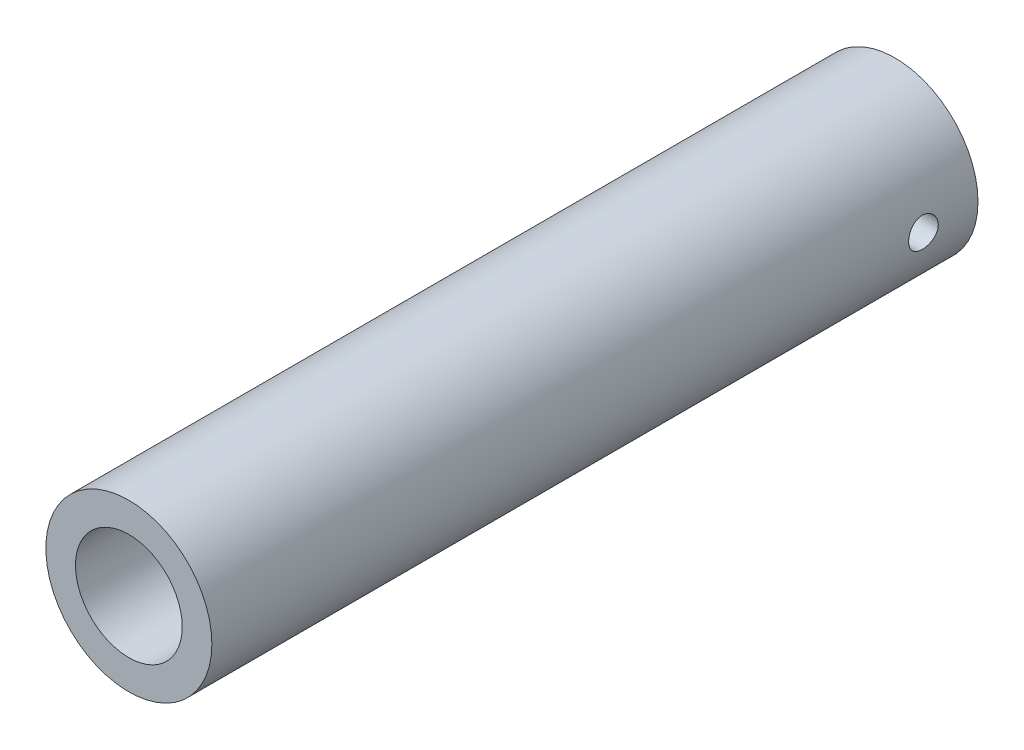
ISO-10303-21;
HEADER;
FILE_DESCRIPTION(('STEP AP214'),'2;1');
FILE_NAME('part.step','',(''),(''),'','','');
FILE_SCHEMA(('AUTOMOTIVE_DESIGN { 1 0 10303 214 1 1 1 1 }'));
ENDSEC;
DATA;
#1=APPLICATION_CONTEXT('core data for automotive mechanical design processes');
#2=APPLICATION_PROTOCOL_DEFINITION('international standard','automotive_design',2000,#1);
#3=PRODUCT_CONTEXT('',#1,'mechanical');
#4=PRODUCT('Part','Part','',(#3));
#5=PRODUCT_RELATED_PRODUCT_CATEGORY('part','',(#4));
#6=PRODUCT_DEFINITION_FORMATION('','',#4);
#7=PRODUCT_DEFINITION_CONTEXT('part definition',#1,'design');
#8=PRODUCT_DEFINITION('design','',#6,#7);
#9=PRODUCT_DEFINITION_SHAPE('','',#8);
#10=(LENGTH_UNIT() NAMED_UNIT(*) SI_UNIT(.MILLI.,.METRE.));
#11=(NAMED_UNIT(*) PLANE_ANGLE_UNIT() SI_UNIT($,.RADIAN.));
#12=(NAMED_UNIT(*) SI_UNIT($,.STERADIAN.) SOLID_ANGLE_UNIT());
#13=UNCERTAINTY_MEASURE_WITH_UNIT(LENGTH_MEASURE(1.E-05),#10,'distance_accuracy_value','');
#14=(GEOMETRIC_REPRESENTATION_CONTEXT(3) GLOBAL_UNCERTAINTY_ASSIGNED_CONTEXT((#13)) GLOBAL_UNIT_ASSIGNED_CONTEXT((#10,
#11,#12)) REPRESENTATION_CONTEXT('',''));
#15=CARTESIAN_POINT('',(0.,0.,0.));
#16=DIRECTION('',(0.,0.,1.));
#17=DIRECTION('',(1.,0.,0.));
#18=AXIS2_PLACEMENT_3D('',#15,#16,#17);
#19=CARTESIAN_POINT('',(0.,0.,129.2));
#20=DIRECTION('',(0.,0.,1.));
#21=DIRECTION('',(1.,0.,0.));
#22=AXIS2_PLACEMENT_3D('',#19,#20,#21);
#23=PLANE('',#22);
#24=CARTESIAN_POINT('',(0.,0.,129.2));
#25=DIRECTION('',(0.,0.,1.));
#26=DIRECTION('',(1.,0.,0.));
#27=AXIS2_PLACEMENT_3D('',#24,#25,#26);
#28=CIRCLE('',#27,14.);
#29=CARTESIAN_POINT('',(14.,0.,129.2));
#30=VERTEX_POINT('',#29);
#31=EDGE_CURVE('E10',#30,#30,#28,.T.);
#32=ORIENTED_EDGE('',*,*,#31,.T.);
#33=EDGE_LOOP('',(#32));
#34=FACE_BOUND('',#33,.T.);
#35=CARTESIAN_POINT('',(0.,0.,129.2));
#36=DIRECTION('',(0.,0.,1.));
#37=DIRECTION('',(1.,0.,0.));
#38=AXIS2_PLACEMENT_3D('',#35,#36,#37);
#39=CIRCLE('',#38,9.);
#40=CARTESIAN_POINT('',(9.,0.,129.2));
#41=VERTEX_POINT('',#40);
#42=EDGE_CURVE('E46',#41,#41,#39,.T.);
#43=ORIENTED_EDGE('',*,*,#42,.F.);
#44=EDGE_LOOP('',(#43));
#45=FACE_BOUND('',#44,.T.);
#46=ADVANCED_FACE('F28',(#34,#45),#23,.T.);
#47=CARTESIAN_POINT('',(0.,0.,0.));
#48=DIRECTION('',(0.,0.,1.));
#49=DIRECTION('',(1.,0.,0.));
#50=AXIS2_PLACEMENT_3D('',#47,#48,#49);
#51=PLANE('',#50);
#52=CARTESIAN_POINT('',(0.,0.,0.));
#53=DIRECTION('',(0.,0.,1.));
#54=DIRECTION('',(1.,0.,0.));
#55=AXIS2_PLACEMENT_3D('',#52,#53,#54);
#56=CIRCLE('',#55,14.);
#57=CARTESIAN_POINT('',(14.,0.,0.));
#58=VERTEX_POINT('',#57);
#59=EDGE_CURVE('E41',#58,#58,#56,.T.);
#60=ORIENTED_EDGE('',*,*,#59,.F.);
#61=EDGE_LOOP('',(#60));
#62=FACE_BOUND('',#61,.T.);
#63=CARTESIAN_POINT('',(0.,0.,0.));
#64=DIRECTION('',(0.,0.,1.));
#65=DIRECTION('',(1.,0.,0.));
#66=AXIS2_PLACEMENT_3D('',#63,#64,#65);
#67=CIRCLE('',#66,9.);
#68=CARTESIAN_POINT('',(9.,0.,0.));
#69=VERTEX_POINT('',#68);
#70=EDGE_CURVE('E75',#69,#69,#67,.T.);
#71=ORIENTED_EDGE('',*,*,#70,.T.);
#72=EDGE_LOOP('',(#71));
#73=FACE_BOUND('',#72,.T.);
#74=ADVANCED_FACE('F83',(#62,#73),#51,.F.);
#75=CARTESIAN_POINT('',(0.,0.,129.2));
#76=DIRECTION('',(0.,0.,-1.));
#77=DIRECTION('',(-1.,0.,0.));
#78=AXIS2_PLACEMENT_3D('',#75,#76,#77);
#79=CYLINDRICAL_SURFACE('',#78,14.);
#80=CARTESIAN_POINT('',(-14.,0.,11.7));
#81=CARTESIAN_POINT('',(-13.9999975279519,-0.139239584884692,11.6999945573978));
#82=CARTESIAN_POINT('',(-13.9979012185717,-0.278551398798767,11.6883280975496));
#83=CARTESIAN_POINT('',(-13.9897405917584,-0.55325746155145,11.6419958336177));
#84=CARTESIAN_POINT('',(-13.9836727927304,-0.688648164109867,11.6073098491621));
#85=CARTESIAN_POINT('',(-13.9682487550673,-0.951498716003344,11.516027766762));
#86=CARTESIAN_POINT('',(-13.9588953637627,-1.07896532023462,11.4594506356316));
#87=CARTESIAN_POINT('',(-13.9379246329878,-1.32258294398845,11.3260443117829));
#88=CARTESIAN_POINT('',(-13.9263075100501,-1.43873504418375,11.2492170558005));
#89=CARTESIAN_POINT('',(-13.9019523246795,-1.65770744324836,11.0766007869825));
#90=CARTESIAN_POINT('',(-13.8892044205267,-1.76038642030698,10.9806338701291));
#91=CARTESIAN_POINT('',(-13.8640984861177,-1.94827611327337,10.7728452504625));
#92=CARTESIAN_POINT('',(-13.851740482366,-2.03348564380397,10.6610224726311));
#93=CARTESIAN_POINT('',(-13.828718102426,-2.18459604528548,10.4237098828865));
#94=CARTESIAN_POINT('',(-13.8180664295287,-2.25035491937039,10.298128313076));
#95=CARTESIAN_POINT('',(-13.799800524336,-2.35978878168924,10.0374788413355));
#96=CARTESIAN_POINT('',(-13.7921860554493,-2.40346549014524,9.90241167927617));
#97=CARTESIAN_POINT('',(-13.7809553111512,-2.46704527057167,9.62813117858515));
#98=CARTESIAN_POINT('',(-13.7772977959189,-2.48719373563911,9.48897644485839));
#99=CARTESIAN_POINT('',(-13.7742705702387,-2.50390640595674,9.20921707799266));
#100=CARTESIAN_POINT('',(-13.7749005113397,-2.50047252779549,9.0686125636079));
#101=CARTESIAN_POINT('',(-13.78033942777,-2.47031736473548,8.79171110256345));
#102=CARTESIAN_POINT('',(-13.7850985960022,-2.44387361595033,8.65538280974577));
#103=CARTESIAN_POINT('',(-13.7981816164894,-2.3688857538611,8.38912936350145));
#104=CARTESIAN_POINT('',(-13.8065056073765,-2.32034078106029,8.25920445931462));
#105=CARTESIAN_POINT('',(-13.8258332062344,-2.20225267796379,8.00862552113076));
#106=CARTESIAN_POINT('',(-13.836851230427,-2.13259607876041,7.88802611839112));
#107=CARTESIAN_POINT('',(-13.8603157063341,-1.97434240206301,7.66012249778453));
#108=CARTESIAN_POINT('',(-13.8727622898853,-1.88574357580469,7.55281950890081));
#109=CARTESIAN_POINT('',(-13.8978993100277,-1.69061708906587,7.35294978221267));
#110=CARTESIAN_POINT('',(-13.9105906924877,-1.58385171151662,7.26061508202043));
#111=CARTESIAN_POINT('',(-13.934623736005,-1.35622200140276,7.09513386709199));
#112=CARTESIAN_POINT('',(-13.9459653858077,-1.23535755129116,7.02198751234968));
#113=CARTESIAN_POINT('',(-13.9660408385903,-0.982729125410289,6.89693097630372));
#114=CARTESIAN_POINT('',(-13.9747718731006,-0.850953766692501,6.8450433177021));
#115=CARTESIAN_POINT('',(-13.9886206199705,-0.580367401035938,6.76420311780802));
#116=CARTESIAN_POINT('',(-13.9937386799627,-0.441557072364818,6.73524836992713));
#117=CARTESIAN_POINT('',(-13.999737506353,-0.162838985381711,6.70141515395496));
#118=CARTESIAN_POINT('',(-14.0006742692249,-0.0229710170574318,6.69621849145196));
#119=CARTESIAN_POINT('',(-13.9983590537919,0.255635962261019,6.70919773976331));
#120=CARTESIAN_POINT('',(-13.9951072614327,0.39437502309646,6.72737261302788));
#121=CARTESIAN_POINT('',(-13.9848150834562,0.665788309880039,6.7863143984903));
#122=CARTESIAN_POINT('',(-13.9778014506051,0.798498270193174,6.82692183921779));
#123=CARTESIAN_POINT('',(-13.960768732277,1.0552266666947,6.92940463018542));
#124=CARTESIAN_POINT('',(-13.9507494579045,1.17924455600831,6.9912813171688));
#125=CARTESIAN_POINT('',(-13.9286773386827,1.4164370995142,7.13526122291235));
#126=CARTESIAN_POINT('',(-13.9166051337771,1.52949072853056,7.21756079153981));
#127=CARTESIAN_POINT('',(-13.8918196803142,1.74029662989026,7.39978265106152));
#128=CARTESIAN_POINT('',(-13.8791063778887,1.8380476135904,7.49970642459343));
#129=CARTESIAN_POINT('',(-13.8542878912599,2.01666949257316,7.71577496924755));
#130=CARTESIAN_POINT('',(-13.8421918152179,2.09732417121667,7.83209970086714));
#131=CARTESIAN_POINT('',(-13.8201546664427,2.23794827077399,8.07683368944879));
#132=CARTESIAN_POINT('',(-13.8102135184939,2.29791841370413,8.20524252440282));
#133=CARTESIAN_POINT('',(-13.7936819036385,2.39515706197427,8.46992617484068));
#134=CARTESIAN_POINT('',(-13.7870762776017,2.43252842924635,8.60616221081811));
#135=CARTESIAN_POINT('',(-13.7779274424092,2.48382895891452,8.88310729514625));
#136=CARTESIAN_POINT('',(-13.7753838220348,2.49776049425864,9.02381588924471));
#137=CARTESIAN_POINT('',(-13.7746664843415,2.50171229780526,9.30354920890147));
#138=CARTESIAN_POINT('',(-13.7764304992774,2.49207328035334,9.44256907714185));
#139=CARTESIAN_POINT('',(-13.7839923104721,2.44989946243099,9.71697381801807));
#140=CARTESIAN_POINT('',(-13.7897900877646,2.4173647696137,9.85235870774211));
#141=CARTESIAN_POINT('',(-13.8047410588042,2.33046113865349,10.1154898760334));
#142=CARTESIAN_POINT('',(-13.8138890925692,2.27612576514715,10.2432475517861));
#143=CARTESIAN_POINT('',(-13.8345140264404,2.14719934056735,10.4878884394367));
#144=CARTESIAN_POINT('',(-13.8459910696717,2.07260704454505,10.6047709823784));
#145=CARTESIAN_POINT('',(-13.8701759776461,1.90408567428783,10.82605704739));
#146=CARTESIAN_POINT('',(-13.882898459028,1.80990741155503,10.9302692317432));
#147=CARTESIAN_POINT('',(-13.9080282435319,1.60540999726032,11.1215258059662));
#148=CARTESIAN_POINT('',(-13.920435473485,1.49508713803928,11.2085662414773));
#149=CARTESIAN_POINT('',(-13.9436534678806,1.26037074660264,11.3636577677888));
#150=CARTESIAN_POINT('',(-13.9544505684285,1.13587103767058,11.4315502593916));
#151=CARTESIAN_POINT('',(-13.9730987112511,0.87708484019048,11.5453492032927));
#152=CARTESIAN_POINT('',(-13.9809525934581,0.742807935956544,11.5912768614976));
#153=CARTESIAN_POINT('',(-13.9911779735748,0.50673175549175,11.6502306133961));
#154=CARTESIAN_POINT('',(-13.9944679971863,0.406334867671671,11.6688631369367));
#155=CARTESIAN_POINT('',(-13.9988798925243,0.20397155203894,11.6937496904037));
#156=CARTESIAN_POINT('',(-14.0000018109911,0.102005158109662,11.7000039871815));
#157=CARTESIAN_POINT('',(-14.,0.,11.7));
#158=B_SPLINE_CURVE_WITH_KNOTS('',3,(#80,#81,#82,#83,#84,#85,#86,#87,#88,#89,#90,#91,#92,#93,
#94,#95,#96,#97,#98,#99,#100,#101,#102,#103,#104,#105,#106,#107,#108,#109,#110,#111,#112,#113,
#114,#115,#116,#117,#118,#119,#120,#121,#122,#123,#124,#125,#126,#127,#128,#129,#130,#131,#132,
#133,#134,#135,#136,#137,#138,#139,#140,#141,#142,#143,#144,#145,#146,#147,#148,#149,#150,#151,
#152,#153,#154,#155,#156,#157),.UNSPECIFIED.,.T.,.F.,(4,2,2,2,2,2,2,2,2,2,2,2,2,2,2,2,2,2,2,2,2,
2,2,2,2,2,2,2,2,2,2,2,2,2,2,2,2,2,4),(0.,0.41734579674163,0.835057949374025,1.25240899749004,
1.66972014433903,2.09110796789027,2.5125243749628,2.93694536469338,3.36133328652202,
3.78125426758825,4.20114112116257,4.61603258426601,5.03094018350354,5.44811857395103,
5.8653354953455,6.28850377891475,6.71167559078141,7.13529458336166,7.55887281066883,
7.97676106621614,8.3946307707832,8.80956740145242,9.2245301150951,9.6436484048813,
10.062801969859,10.4869762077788,10.9111356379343,11.3333496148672,11.7555208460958,
12.1716257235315,12.5877286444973,13.0031933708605,13.4186836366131,13.8398246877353,
14.2610626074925,14.6856934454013,15.109913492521,15.4156623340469,15.7214045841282),.UNSPECIFIED.);
#159=CARTESIAN_POINT('',(-14.,0.,11.7));
#160=VERTEX_POINT('',#159);
#161=EDGE_CURVE('E70',#160,#160,#158,.T.);
#162=ORIENTED_EDGE('',*,*,#161,.T.);
#163=EDGE_LOOP('',(#162));
#164=FACE_BOUND('',#163,.T.);
#165=CARTESIAN_POINT('',(14.,0.,6.7));
#166=CARTESIAN_POINT('',(13.9999975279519,-0.139239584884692,6.70000544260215));
#167=CARTESIAN_POINT('',(13.9979012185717,-0.278551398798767,6.71167190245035));
#168=CARTESIAN_POINT('',(13.9897405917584,-0.55325746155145,6.7580041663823));
#169=CARTESIAN_POINT('',(13.9836727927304,-0.688648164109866,6.79269015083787));
#170=CARTESIAN_POINT('',(13.9682487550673,-0.951498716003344,6.88397223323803));
#171=CARTESIAN_POINT('',(13.9588953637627,-1.07896532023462,6.9405493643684));
#172=CARTESIAN_POINT('',(13.9379246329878,-1.32258294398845,7.07395568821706));
#173=CARTESIAN_POINT('',(13.9263075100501,-1.43873504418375,7.15078294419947));
#174=CARTESIAN_POINT('',(13.9019523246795,-1.65770744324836,7.32339921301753));
#175=CARTESIAN_POINT('',(13.8892044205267,-1.76038642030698,7.4193661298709));
#176=CARTESIAN_POINT('',(13.8640984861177,-1.94827611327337,7.62715474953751));
#177=CARTESIAN_POINT('',(13.851740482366,-2.03348564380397,7.73897752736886));
#178=CARTESIAN_POINT('',(13.828718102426,-2.18459604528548,7.97629011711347));
#179=CARTESIAN_POINT('',(13.8180664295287,-2.25035491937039,8.10187168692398));
#180=CARTESIAN_POINT('',(13.799800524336,-2.35978878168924,8.3625211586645));
#181=CARTESIAN_POINT('',(13.7921860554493,-2.40346549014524,8.49758832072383));
#182=CARTESIAN_POINT('',(13.7809553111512,-2.46704527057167,8.77186882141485));
#183=CARTESIAN_POINT('',(13.7772977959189,-2.48719373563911,8.91102355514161));
#184=CARTESIAN_POINT('',(13.7742705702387,-2.50390640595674,9.19078292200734));
#185=CARTESIAN_POINT('',(13.7749005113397,-2.50047252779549,9.3313874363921));
#186=CARTESIAN_POINT('',(13.78033942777,-2.47031736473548,9.60828889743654));
#187=CARTESIAN_POINT('',(13.7850985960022,-2.44387361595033,9.74461719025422));
#188=CARTESIAN_POINT('',(13.7981816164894,-2.3688857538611,10.0108706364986));
#189=CARTESIAN_POINT('',(13.8065056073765,-2.32034078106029,10.1407955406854));
#190=CARTESIAN_POINT('',(13.8258332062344,-2.2022526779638,10.3913744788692));
#191=CARTESIAN_POINT('',(13.836851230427,-2.13259607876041,10.5119738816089));
#192=CARTESIAN_POINT('',(13.8603157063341,-1.97434240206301,10.7398775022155));
#193=CARTESIAN_POINT('',(13.8727622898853,-1.88574357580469,10.8471804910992));
#194=CARTESIAN_POINT('',(13.8978993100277,-1.69061708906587,11.0470502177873));
#195=CARTESIAN_POINT('',(13.9105906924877,-1.58385171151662,11.1393849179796));
#196=CARTESIAN_POINT('',(13.934623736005,-1.35622200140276,11.304866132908));
#197=CARTESIAN_POINT('',(13.9459653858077,-1.23535755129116,11.3780124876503));
#198=CARTESIAN_POINT('',(13.9660408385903,-0.982729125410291,11.5030690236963));
#199=CARTESIAN_POINT('',(13.9747718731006,-0.850953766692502,11.5549566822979));
#200=CARTESIAN_POINT('',(13.9886206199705,-0.58036740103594,11.635796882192));
#201=CARTESIAN_POINT('',(13.9937386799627,-0.44155707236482,11.6647516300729));
#202=CARTESIAN_POINT('',(13.999737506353,-0.162838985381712,11.698584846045));
#203=CARTESIAN_POINT('',(14.0006742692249,-0.0229710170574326,11.703781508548));
#204=CARTESIAN_POINT('',(13.9983590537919,0.255635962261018,11.6908022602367));
#205=CARTESIAN_POINT('',(13.9951072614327,0.394375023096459,11.6726273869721));
#206=CARTESIAN_POINT('',(13.9848150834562,0.665788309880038,11.6136856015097));
#207=CARTESIAN_POINT('',(13.9778014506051,0.798498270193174,11.5730781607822));
#208=CARTESIAN_POINT('',(13.960768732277,1.0552266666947,11.4705953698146));
#209=CARTESIAN_POINT('',(13.9507494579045,1.17924455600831,11.4087186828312));
#210=CARTESIAN_POINT('',(13.9286773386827,1.4164370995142,11.2647387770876));
#211=CARTESIAN_POINT('',(13.9166051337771,1.52949072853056,11.1824392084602));
#212=CARTESIAN_POINT('',(13.8918196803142,1.74029662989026,11.0002173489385));
#213=CARTESIAN_POINT('',(13.8791063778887,1.8380476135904,10.9002935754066));
#214=CARTESIAN_POINT('',(13.8542878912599,2.01666949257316,10.6842250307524));
#215=CARTESIAN_POINT('',(13.8421918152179,2.09732417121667,10.5679002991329));
#216=CARTESIAN_POINT('',(13.8201546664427,2.23794827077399,10.3231663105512));
#217=CARTESIAN_POINT('',(13.8102135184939,2.29791841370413,10.1947574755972));
#218=CARTESIAN_POINT('',(13.7936819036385,2.39515706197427,9.93007382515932));
#219=CARTESIAN_POINT('',(13.7870762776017,2.43252842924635,9.79383778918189));
#220=CARTESIAN_POINT('',(13.7779274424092,2.48382895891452,9.51689270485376));
#221=CARTESIAN_POINT('',(13.7753838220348,2.49776049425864,9.37618411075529));
#222=CARTESIAN_POINT('',(13.7746664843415,2.50171229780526,9.09645079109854));
#223=CARTESIAN_POINT('',(13.7764304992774,2.49207328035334,8.95743092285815));
#224=CARTESIAN_POINT('',(13.7839923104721,2.44989946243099,8.68302618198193));
#225=CARTESIAN_POINT('',(13.7897900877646,2.4173647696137,8.5476412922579));
#226=CARTESIAN_POINT('',(13.8047410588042,2.33046113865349,8.28451012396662));
#227=CARTESIAN_POINT('',(13.8138890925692,2.27612576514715,8.15675244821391));
#228=CARTESIAN_POINT('',(13.8345140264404,2.14719934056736,7.91211156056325));
#229=CARTESIAN_POINT('',(13.8459910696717,2.07260704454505,7.7952290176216));
#230=CARTESIAN_POINT('',(13.8701759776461,1.90408567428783,7.57394295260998));
#231=CARTESIAN_POINT('',(13.882898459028,1.80990741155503,7.46973076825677));
#232=CARTESIAN_POINT('',(13.9080282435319,1.60540999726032,7.27847419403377));
#233=CARTESIAN_POINT('',(13.920435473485,1.49508713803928,7.19143375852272));
#234=CARTESIAN_POINT('',(13.9436534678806,1.26037074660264,7.03634223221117));
#235=CARTESIAN_POINT('',(13.9544505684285,1.13587103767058,6.96844974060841));
#236=CARTESIAN_POINT('',(13.9730987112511,0.877084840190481,6.85465079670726));
#237=CARTESIAN_POINT('',(13.9809525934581,0.742807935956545,6.80872313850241));
#238=CARTESIAN_POINT('',(13.9911779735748,0.506731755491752,6.74976938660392));
#239=CARTESIAN_POINT('',(13.9944679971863,0.406334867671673,6.73113686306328));
#240=CARTESIAN_POINT('',(13.9988798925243,0.203971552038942,6.70625030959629));
#241=CARTESIAN_POINT('',(14.0000018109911,0.102005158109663,6.69999601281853));
#242=CARTESIAN_POINT('',(14.,0.,6.7));
#243=B_SPLINE_CURVE_WITH_KNOTS('',3,(#165,#166,#167,#168,#169,#170,#171,#172,#173,#174,#175,
#176,#177,#178,#179,#180,#181,#182,#183,#184,#185,#186,#187,#188,#189,#190,#191,#192,#193,#194,
#195,#196,#197,#198,#199,#200,#201,#202,#203,#204,#205,#206,#207,#208,#209,#210,#211,#212,#213,
#214,#215,#216,#217,#218,#219,#220,#221,#222,#223,#224,#225,#226,#227,#228,#229,#230,#231,#232,
#233,#234,#235,#236,#237,#238,#239,#240,#241,#242),.UNSPECIFIED.,.T.,.F.,(4,2,2,2,2,2,2,2,2,2,2,
2,2,2,2,2,2,2,2,2,2,2,2,2,2,2,2,2,2,2,2,2,2,2,2,2,2,2,4),(0.,0.41734579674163,0.835057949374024,
1.25240899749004,1.66972014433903,2.09110796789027,2.5125243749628,2.93694536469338,
3.36133328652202,3.78125426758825,4.20114112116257,4.61603258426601,5.03094018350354,
5.44811857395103,5.8653354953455,6.28850377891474,6.71167559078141,7.13529458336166,
7.55887281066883,7.97676106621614,8.3946307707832,8.80956740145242,9.2245301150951,
9.6436484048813,10.062801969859,10.4869762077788,10.9111356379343,11.3333496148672,
11.7555208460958,12.1716257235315,12.5877286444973,13.0031933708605,13.4186836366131,
13.8398246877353,14.2610626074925,14.6856934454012,15.109913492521,15.4156623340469,
15.7214045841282),.UNSPECIFIED.);
#244=CARTESIAN_POINT('',(14.,0.,6.7));
#245=VERTEX_POINT('',#244);
#246=EDGE_CURVE('E66',#245,#245,#243,.T.);
#247=ORIENTED_EDGE('',*,*,#246,.T.);
#248=EDGE_LOOP('',(#247));
#249=FACE_BOUND('',#248,.T.);
#250=ORIENTED_EDGE('',*,*,#31,.F.);
#251=EDGE_LOOP('',(#250));
#252=FACE_BOUND('',#251,.T.);
#253=ORIENTED_EDGE('',*,*,#59,.T.);
#254=EDGE_LOOP('',(#253));
#255=FACE_BOUND('',#254,.T.);
#256=ADVANCED_FACE('F30',(#164,#249,#252,#255),#79,.T.);
#257=CARTESIAN_POINT('',(0.,0.,129.2));
#258=DIRECTION('',(0.,0.,-1.));
#259=DIRECTION('',(-1.,0.,0.));
#260=AXIS2_PLACEMENT_3D('',#257,#258,#259);
#261=CYLINDRICAL_SURFACE('',#260,9.);
#262=CARTESIAN_POINT('',(-9.,0.,11.7));
#263=CARTESIAN_POINT('',(-8.99999816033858,-0.137602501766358,11.6999972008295));
#264=CARTESIAN_POINT('',(-8.99681348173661,-0.275234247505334,11.6886013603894));
#265=CARTESIAN_POINT('',(-8.98441900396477,-0.546518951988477,11.6434085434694));
#266=CARTESIAN_POINT('',(-8.97520666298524,-0.680170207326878,11.6096021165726));
#267=CARTESIAN_POINT('',(-8.95177130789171,-0.939539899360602,11.5207825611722));
#268=CARTESIAN_POINT('',(-8.93755506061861,-1.06526878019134,11.4657980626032));
#269=CARTESIAN_POINT('',(-8.90560625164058,-1.30572139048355,11.3362929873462));
#270=CARTESIAN_POINT('',(-8.88787337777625,-1.4204441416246,11.2617706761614));
#271=CARTESIAN_POINT('',(-8.85030315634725,-1.63849356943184,11.0933411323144));
#272=CARTESIAN_POINT('',(-8.83042747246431,-1.74150622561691,10.9990359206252));
#273=CARTESIAN_POINT('',(-8.79105214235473,-1.93047637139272,10.7945674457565));
#274=CARTESIAN_POINT('',(-8.77155254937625,-2.01643146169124,10.6844019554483));
#275=CARTESIAN_POINT('',(-8.73474088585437,-2.1704161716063,10.4487854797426));
#276=CARTESIAN_POINT('',(-8.717476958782,-2.23807749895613,10.3230855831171));
#277=CARTESIAN_POINT('',(-8.68765801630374,-2.35117914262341,10.0615361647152));
#278=CARTESIAN_POINT('',(-8.675102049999,-2.39662394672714,9.92568869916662));
#279=CARTESIAN_POINT('',(-8.65651766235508,-2.46289848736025,9.65119442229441));
#280=CARTESIAN_POINT('',(-8.65033771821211,-2.48430073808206,9.51269635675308));
#281=CARTESIAN_POINT('',(-8.644752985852,-2.50366854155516,9.23394822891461));
#282=CARTESIAN_POINT('',(-8.64534681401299,-2.50163888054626,9.09369853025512));
#283=CARTESIAN_POINT('',(-8.65310733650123,-2.4746534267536,8.81995544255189));
#284=CARTESIAN_POINT('',(-8.66007321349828,-2.45039804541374,8.68638639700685));
#285=CARTESIAN_POINT('',(-8.67947034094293,-2.38077462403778,8.42529274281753));
#286=CARTESIAN_POINT('',(-8.6919020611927,-2.33540476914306,8.29776865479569));
#287=CARTESIAN_POINT('',(-8.72100139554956,-2.22428746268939,8.05059553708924));
#288=CARTESIAN_POINT('',(-8.73771837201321,-2.15830043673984,7.93106026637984));
#289=CARTESIAN_POINT('',(-8.77347901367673,-2.00798881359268,7.70451684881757));
#290=CARTESIAN_POINT('',(-8.79252317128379,-1.9236603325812,7.59751136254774));
#291=CARTESIAN_POINT('',(-8.83162144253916,-1.73551122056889,7.39507223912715));
#292=CARTESIAN_POINT('',(-8.85168740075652,-1.63110455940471,7.30018473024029));
#293=CARTESIAN_POINT('',(-8.88996399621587,-1.40761321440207,7.12914853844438));
#294=CARTESIAN_POINT('',(-8.90817454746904,-1.28852785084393,7.05300072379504));
#295=CARTESIAN_POINT('',(-8.9408167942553,-1.03816685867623,6.92133636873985));
#296=CARTESIAN_POINT('',(-8.95522897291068,-0.906832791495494,6.86592579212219));
#297=CARTESIAN_POINT('',(-8.97850985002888,-0.636219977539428,6.77813180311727));
#298=CARTESIAN_POINT('',(-8.98737986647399,-0.496943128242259,6.74574291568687));
#299=CARTESIAN_POINT('',(-8.99837472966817,-0.219053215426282,6.70578572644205));
#300=CARTESIAN_POINT('',(-9.00070107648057,-0.0805546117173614,6.69747571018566));
#301=CARTESIAN_POINT('',(-8.99892960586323,0.195859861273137,6.70385399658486));
#302=CARTESIAN_POINT('',(-8.9948325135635,0.333775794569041,6.71853970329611));
#303=CARTESIAN_POINT('',(-8.98080530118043,0.602413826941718,6.76988666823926));
#304=CARTESIAN_POINT('',(-8.97098674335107,0.733222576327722,6.80612789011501));
#305=CARTESIAN_POINT('',(-8.94663658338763,0.986886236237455,6.89906373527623));
#306=CARTESIAN_POINT('',(-8.93210444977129,1.10974024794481,6.95576066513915));
#307=CARTESIAN_POINT('',(-8.89947480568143,1.34684028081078,7.08933175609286));
#308=CARTESIAN_POINT('',(-8.88130942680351,1.4608541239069,7.16660104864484));
#309=CARTESIAN_POINT('',(-8.84350954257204,1.67455534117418,7.33863227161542));
#310=CARTESIAN_POINT('',(-8.82387472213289,1.77423962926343,7.43339796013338));
#311=CARTESIAN_POINT('',(-8.78459685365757,1.9596240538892,7.64120288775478));
#312=CARTESIAN_POINT('',(-8.76497216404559,2.04479915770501,7.75471490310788));
#313=CARTESIAN_POINT('',(-8.72859386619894,2.1949116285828,7.99484127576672));
#314=CARTESIAN_POINT('',(-8.71184014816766,2.25984976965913,8.12145513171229));
#315=CARTESIAN_POINT('',(-8.68329597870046,2.36716211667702,8.38361433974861));
#316=CARTESIAN_POINT('',(-8.67147806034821,2.40966154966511,8.51910527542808));
#317=CARTESIAN_POINT('',(-8.65415753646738,2.47115304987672,8.79569941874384));
#318=CARTESIAN_POINT('',(-8.64865314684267,2.49015175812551,8.93680102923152));
#319=CARTESIAN_POINT('',(-8.64474076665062,2.50369719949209,9.21521155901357));
#320=CARTESIAN_POINT('',(-8.64608680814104,2.49909142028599,9.35247638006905));
#321=CARTESIAN_POINT('',(-8.65514273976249,2.4675428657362,9.62418978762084));
#322=CARTESIAN_POINT('',(-8.66285243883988,2.4406007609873,9.75863845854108));
#323=CARTESIAN_POINT('',(-8.68361437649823,2.36565448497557,10.0197344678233));
#324=CARTESIAN_POINT('',(-8.69661733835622,2.31784429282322,10.1464416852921));
#325=CARTESIAN_POINT('',(-8.72649832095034,2.2026690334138,10.3901348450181));
#326=CARTESIAN_POINT('',(-8.74337699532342,2.13530066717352,10.5071191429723));
#327=CARTESIAN_POINT('',(-8.77977621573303,1.98041392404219,10.7320553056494));
#328=CARTESIAN_POINT('',(-8.79936357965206,1.8923241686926,10.8396029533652));
#329=CARTESIAN_POINT('',(-8.83861663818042,1.69956305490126,11.0386647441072));
#330=CARTESIAN_POINT('',(-8.85828235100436,1.59488759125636,11.130174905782));
#331=CARTESIAN_POINT('',(-8.89603679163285,1.36892046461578,11.2967162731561));
#332=CARTESIAN_POINT('',(-8.91407682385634,1.24729251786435,11.3713032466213));
#333=CARTESIAN_POINT('',(-8.9459994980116,0.992723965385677,11.498856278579));
#334=CARTESIAN_POINT('',(-8.95988458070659,0.859790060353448,11.551835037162));
#335=CARTESIAN_POINT('',(-8.98032149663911,0.6062909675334,11.6284401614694));
#336=CARTESIAN_POINT('',(-8.98764491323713,0.486728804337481,11.6552095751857));
#337=CARTESIAN_POINT('',(-8.99748469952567,0.244785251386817,11.6909896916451));
#338=CARTESIAN_POINT('',(-9.00000163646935,0.12240419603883,11.7000024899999));
#339=CARTESIAN_POINT('',(-9.,0.,11.7));
#340=B_SPLINE_CURVE_WITH_KNOTS('',3,(#262,#263,#264,#265,#266,#267,#268,#269,#270,#271,#272,
#273,#274,#275,#276,#277,#278,#279,#280,#281,#282,#283,#284,#285,#286,#287,#288,#289,#290,#291,
#292,#293,#294,#295,#296,#297,#298,#299,#300,#301,#302,#303,#304,#305,#306,#307,#308,#309,#310,
#311,#312,#313,#314,#315,#316,#317,#318,#319,#320,#321,#322,#323,#324,#325,#326,#327,#328,#329,
#330,#331,#332,#333,#334,#335,#336,#337,#338,#339),.UNSPECIFIED.,.T.,.F.,(4,2,2,2,2,2,2,2,2,2,2,
2,2,2,2,2,2,2,2,2,2,2,2,2,2,2,2,2,2,2,2,2,2,2,2,2,2,2,4),(0.,0.412358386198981,
0.824890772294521,1.23686741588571,1.64888064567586,2.07015248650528,2.4914835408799,
2.92075380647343,3.34993732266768,3.76866863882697,4.18731442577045,4.593204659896,
4.99912978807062,5.40995920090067,5.82087569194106,6.2463898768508,6.67192377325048,
7.09960331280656,7.5271811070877,7.94144021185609,8.35565255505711,8.76204634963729,
9.16848598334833,9.58337897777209,9.99836119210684,10.4261198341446,10.8538621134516,
11.279191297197,11.7044002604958,12.114451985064,12.5244913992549,12.9307978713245,
13.3371729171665,13.7564382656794,14.1758075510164,14.6051618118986,15.0342633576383,
15.4011197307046,15.7679328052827),.UNSPECIFIED.);
#341=CARTESIAN_POINT('',(-9.,0.,11.7));
#342=VERTEX_POINT('',#341);
#343=EDGE_CURVE('E33',#342,#342,#340,.T.);
#344=ORIENTED_EDGE('',*,*,#343,.F.);
#345=EDGE_LOOP('',(#344));
#346=FACE_BOUND('',#345,.T.);
#347=CARTESIAN_POINT('',(9.,0.,6.7));
#348=CARTESIAN_POINT('',(8.99999816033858,-0.137602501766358,6.70000279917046));
#349=CARTESIAN_POINT('',(8.99681348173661,-0.275234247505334,6.71139863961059));
#350=CARTESIAN_POINT('',(8.98441900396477,-0.546518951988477,6.75659145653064));
#351=CARTESIAN_POINT('',(8.97520666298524,-0.680170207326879,6.79039788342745));
#352=CARTESIAN_POINT('',(8.95177130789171,-0.939539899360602,6.87921743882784));
#353=CARTESIAN_POINT('',(8.93755506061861,-1.06526878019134,6.93420193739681));
#354=CARTESIAN_POINT('',(8.90560625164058,-1.30572139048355,7.06370701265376));
#355=CARTESIAN_POINT('',(8.88787337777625,-1.4204441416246,7.13822932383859));
#356=CARTESIAN_POINT('',(8.85030315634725,-1.63849356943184,7.30665886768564));
#357=CARTESIAN_POINT('',(8.83042747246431,-1.7415062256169,7.40096407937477));
#358=CARTESIAN_POINT('',(8.79105214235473,-1.93047637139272,7.6054325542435));
#359=CARTESIAN_POINT('',(8.77155254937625,-2.01643146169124,7.71559804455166));
#360=CARTESIAN_POINT('',(8.73474088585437,-2.1704161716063,7.95121452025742));
#361=CARTESIAN_POINT('',(8.717476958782,-2.23807749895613,8.07691441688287));
#362=CARTESIAN_POINT('',(8.68765801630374,-2.35117914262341,8.33846383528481));
#363=CARTESIAN_POINT('',(8.675102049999,-2.39662394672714,8.47431130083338));
#364=CARTESIAN_POINT('',(8.65651766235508,-2.46289848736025,8.74880557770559));
#365=CARTESIAN_POINT('',(8.65033771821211,-2.48430073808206,8.88730364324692));
#366=CARTESIAN_POINT('',(8.644752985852,-2.50366854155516,9.16605177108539));
#367=CARTESIAN_POINT('',(8.64534681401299,-2.50163888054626,9.30630146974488));
#368=CARTESIAN_POINT('',(8.65310733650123,-2.4746534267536,9.58004455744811));
#369=CARTESIAN_POINT('',(8.66007321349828,-2.45039804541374,9.71361360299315));
#370=CARTESIAN_POINT('',(8.67947034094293,-2.38077462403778,9.97470725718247));
#371=CARTESIAN_POINT('',(8.6919020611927,-2.33540476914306,10.1022313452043));
#372=CARTESIAN_POINT('',(8.72100139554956,-2.22428746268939,10.3494044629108));
#373=CARTESIAN_POINT('',(8.73771837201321,-2.15830043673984,10.4689397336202));
#374=CARTESIAN_POINT('',(8.77347901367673,-2.00798881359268,10.6954831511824));
#375=CARTESIAN_POINT('',(8.79252317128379,-1.9236603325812,10.8024886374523));
#376=CARTESIAN_POINT('',(8.83162144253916,-1.73551122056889,11.0049277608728));
#377=CARTESIAN_POINT('',(8.85168740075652,-1.63110455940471,11.0998152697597));
#378=CARTESIAN_POINT('',(8.88996399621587,-1.40761321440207,11.2708514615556));
#379=CARTESIAN_POINT('',(8.90817454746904,-1.28852785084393,11.346999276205));
#380=CARTESIAN_POINT('',(8.9408167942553,-1.03816685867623,11.4786636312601));
#381=CARTESIAN_POINT('',(8.95522897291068,-0.906832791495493,11.5340742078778));
#382=CARTESIAN_POINT('',(8.97850985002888,-0.636219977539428,11.6218681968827));
#383=CARTESIAN_POINT('',(8.98737986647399,-0.496943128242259,11.6542570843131));
#384=CARTESIAN_POINT('',(8.99837472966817,-0.219053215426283,11.6942142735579));
#385=CARTESIAN_POINT('',(9.00070107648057,-0.0805546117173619,11.7025242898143));
#386=CARTESIAN_POINT('',(8.99892960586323,0.195859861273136,11.6961460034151));
#387=CARTESIAN_POINT('',(8.9948325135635,0.333775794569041,11.6814602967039));
#388=CARTESIAN_POINT('',(8.98080530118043,0.602413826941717,11.6301133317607));
#389=CARTESIAN_POINT('',(8.97098674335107,0.733222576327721,11.593872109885));
#390=CARTESIAN_POINT('',(8.94663658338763,0.986886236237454,11.5009362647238));
#391=CARTESIAN_POINT('',(8.93210444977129,1.10974024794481,11.4442393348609));
#392=CARTESIAN_POINT('',(8.89947480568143,1.34684028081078,11.3106682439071));
#393=CARTESIAN_POINT('',(8.88130942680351,1.4608541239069,11.2333989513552));
#394=CARTESIAN_POINT('',(8.84350954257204,1.67455534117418,11.0613677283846));
#395=CARTESIAN_POINT('',(8.82387472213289,1.77423962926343,10.9666020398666));
#396=CARTESIAN_POINT('',(8.78459685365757,1.9596240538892,10.7587971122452));
#397=CARTESIAN_POINT('',(8.76497216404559,2.04479915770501,10.6452850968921));
#398=CARTESIAN_POINT('',(8.72859386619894,2.1949116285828,10.4051587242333));
#399=CARTESIAN_POINT('',(8.71184014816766,2.25984976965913,10.2785448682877));
#400=CARTESIAN_POINT('',(8.68329597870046,2.36716211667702,10.0163856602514));
#401=CARTESIAN_POINT('',(8.67147806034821,2.40966154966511,9.88089472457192));
#402=CARTESIAN_POINT('',(8.65415753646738,2.47115304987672,9.60430058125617));
#403=CARTESIAN_POINT('',(8.64865314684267,2.49015175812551,9.46319897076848));
#404=CARTESIAN_POINT('',(8.64474076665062,2.50369719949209,9.18478844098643));
#405=CARTESIAN_POINT('',(8.64608680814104,2.49909142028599,9.04752361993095));
#406=CARTESIAN_POINT('',(8.65514273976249,2.4675428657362,8.77581021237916));
#407=CARTESIAN_POINT('',(8.66285243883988,2.4406007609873,8.64136154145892));
#408=CARTESIAN_POINT('',(8.68361437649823,2.36565448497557,8.38026553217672));
#409=CARTESIAN_POINT('',(8.69661733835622,2.31784429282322,8.25355831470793));
#410=CARTESIAN_POINT('',(8.72649832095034,2.2026690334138,8.00986515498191));
#411=CARTESIAN_POINT('',(8.74337699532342,2.13530066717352,7.89288085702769));
#412=CARTESIAN_POINT('',(8.77977621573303,1.98041392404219,7.66794469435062));
#413=CARTESIAN_POINT('',(8.79936357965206,1.8923241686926,7.56039704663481));
#414=CARTESIAN_POINT('',(8.83861663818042,1.69956305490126,7.36133525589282));
#415=CARTESIAN_POINT('',(8.85828235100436,1.59488759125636,7.26982509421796));
#416=CARTESIAN_POINT('',(8.89603679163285,1.36892046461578,7.10328372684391));
#417=CARTESIAN_POINT('',(8.91407682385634,1.24729251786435,7.02869675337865));
#418=CARTESIAN_POINT('',(8.9459994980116,0.992723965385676,6.90114372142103));
#419=CARTESIAN_POINT('',(8.95988458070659,0.859790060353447,6.84816496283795));
#420=CARTESIAN_POINT('',(8.98032149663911,0.6062909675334,6.77155983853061));
#421=CARTESIAN_POINT('',(8.98764491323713,0.486728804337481,6.74479042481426));
#422=CARTESIAN_POINT('',(8.99748469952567,0.244785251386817,6.70901030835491));
#423=CARTESIAN_POINT('',(9.00000163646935,0.12240419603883,6.69999751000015));
#424=CARTESIAN_POINT('',(9.,0.,6.7));
#425=B_SPLINE_CURVE_WITH_KNOTS('',3,(#347,#348,#349,#350,#351,#352,#353,#354,#355,#356,#357,
#358,#359,#360,#361,#362,#363,#364,#365,#366,#367,#368,#369,#370,#371,#372,#373,#374,#375,#376,
#377,#378,#379,#380,#381,#382,#383,#384,#385,#386,#387,#388,#389,#390,#391,#392,#393,#394,#395,
#396,#397,#398,#399,#400,#401,#402,#403,#404,#405,#406,#407,#408,#409,#410,#411,#412,#413,#414,
#415,#416,#417,#418,#419,#420,#421,#422,#423,#424),.UNSPECIFIED.,.T.,.F.,(4,2,2,2,2,2,2,2,2,2,2,
2,2,2,2,2,2,2,2,2,2,2,2,2,2,2,2,2,2,2,2,2,2,2,2,2,2,2,4),(0.,0.412358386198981,
0.824890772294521,1.23686741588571,1.64888064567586,2.07015248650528,2.4914835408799,
2.92075380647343,3.34993732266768,3.76866863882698,4.18731442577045,4.593204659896,
4.99912978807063,5.40995920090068,5.82087569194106,6.2463898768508,6.67192377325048,
7.09960331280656,7.5271811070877,7.94144021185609,8.35565255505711,8.76204634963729,
9.16848598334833,9.58337897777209,9.99836119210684,10.4261198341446,10.8538621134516,
11.279191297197,11.7044002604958,12.114451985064,12.5244913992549,12.9307978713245,
13.3371729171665,13.7564382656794,14.1758075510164,14.6051618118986,15.0342633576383,
15.4011197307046,15.7679328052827),.UNSPECIFIED.);
#426=CARTESIAN_POINT('',(9.,0.,6.7));
#427=VERTEX_POINT('',#426);
#428=EDGE_CURVE('E49',#427,#427,#425,.T.);
#429=ORIENTED_EDGE('',*,*,#428,.F.);
#430=EDGE_LOOP('',(#429));
#431=FACE_BOUND('',#430,.T.);
#432=ORIENTED_EDGE('',*,*,#42,.T.);
#433=EDGE_LOOP('',(#432));
#434=FACE_BOUND('',#433,.T.);
#435=ORIENTED_EDGE('',*,*,#70,.F.);
#436=EDGE_LOOP('',(#435));
#437=FACE_BOUND('',#436,.T.);
#438=ADVANCED_FACE('F53',(#346,#431,#434,#437),#261,.F.);
#439=CARTESIAN_POINT('',(-15.,0.,9.2));
#440=DIRECTION('',(1.,0.,0.));
#441=DIRECTION('',(0.,0.,-1.));
#442=AXIS2_PLACEMENT_3D('',#439,#440,#441);
#443=CYLINDRICAL_SURFACE('',#442,2.5);
#444=ORIENTED_EDGE('',*,*,#428,.T.);
#445=EDGE_LOOP('',(#444));
#446=FACE_BOUND('',#445,.T.);
#447=ORIENTED_EDGE('',*,*,#246,.F.);
#448=EDGE_LOOP('',(#447));
#449=FACE_BOUND('',#448,.T.);
#450=ADVANCED_FACE('F59',(#446,#449),#443,.F.);
#451=ORIENTED_EDGE('',*,*,#343,.T.);
#452=EDGE_LOOP('',(#451));
#453=FACE_BOUND('',#452,.T.);
#454=ORIENTED_EDGE('',*,*,#161,.F.);
#455=EDGE_LOOP('',(#454));
#456=FACE_BOUND('',#455,.T.);
#457=ADVANCED_FACE('F56',(#453,#456),#443,.F.);
#458=CLOSED_SHELL('',(#46,#74,#256,#438,#450,#457));
#459=MANIFOLD_SOLID_BREP('B2',#458);
#460=ADVANCED_BREP_SHAPE_REPRESENTATION('',(#18,#459),#14);
#461=SHAPE_DEFINITION_REPRESENTATION(#9,#460);
ENDSEC;
END-ISO-10303-21;
